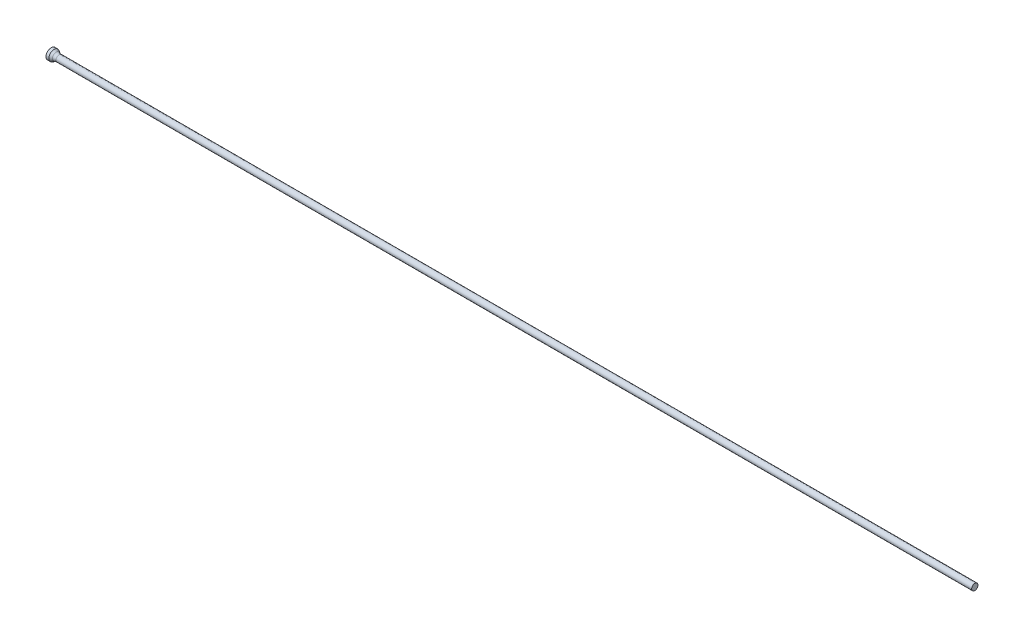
ISO-10303-21;
HEADER;
FILE_DESCRIPTION(('STEP AP214'),'2;1');
FILE_NAME('part.step','',(''),(''),'','','');
FILE_SCHEMA(('AUTOMOTIVE_DESIGN { 1 0 10303 214 1 1 1 1 }'));
ENDSEC;
DATA;
#1=APPLICATION_CONTEXT('core data for automotive mechanical design processes');
#2=APPLICATION_PROTOCOL_DEFINITION('international standard','automotive_design',2000,#1);
#3=PRODUCT_CONTEXT('',#1,'mechanical');
#4=PRODUCT('Part','Part','',(#3));
#5=PRODUCT_RELATED_PRODUCT_CATEGORY('part','',(#4));
#6=PRODUCT_DEFINITION_FORMATION('','',#4);
#7=PRODUCT_DEFINITION_CONTEXT('part definition',#1,'design');
#8=PRODUCT_DEFINITION('design','',#6,#7);
#9=PRODUCT_DEFINITION_SHAPE('','',#8);
#10=(LENGTH_UNIT() NAMED_UNIT(*) SI_UNIT(.MILLI.,.METRE.));
#11=(NAMED_UNIT(*) PLANE_ANGLE_UNIT() SI_UNIT($,.RADIAN.));
#12=(NAMED_UNIT(*) SI_UNIT($,.STERADIAN.) SOLID_ANGLE_UNIT());
#13=UNCERTAINTY_MEASURE_WITH_UNIT(LENGTH_MEASURE(1.E-05),#10,'distance_accuracy_value','');
#14=(GEOMETRIC_REPRESENTATION_CONTEXT(3) GLOBAL_UNCERTAINTY_ASSIGNED_CONTEXT((#13)) GLOBAL_UNIT_ASSIGNED_CONTEXT((#10,
#11,#12)) REPRESENTATION_CONTEXT('',''));
#15=CARTESIAN_POINT('',(0.,0.,0.));
#16=DIRECTION('',(0.,0.,1.));
#17=DIRECTION('',(1.,0.,0.));
#18=AXIS2_PLACEMENT_3D('',#15,#16,#17);
#19=CARTESIAN_POINT('',(0.,0.,0.));
#20=DIRECTION('',(1.,0.,0.));
#21=DIRECTION('',(0.,0.,-1.));
#22=AXIS2_PLACEMENT_3D('',#19,#20,#21);
#23=PLANE('',#22);
#24=CARTESIAN_POINT('',(0.,0.,0.));
#25=DIRECTION('',(-1.,0.,0.));
#26=DIRECTION('',(0.,0.,1.));
#27=AXIS2_PLACEMENT_3D('',#24,#25,#26);
#28=CIRCLE('',#27,0.9);
#29=CARTESIAN_POINT('',(0.,0.,0.9));
#30=VERTEX_POINT('',#29);
#31=EDGE_CURVE('E25',#30,#30,#28,.T.);
#32=ORIENTED_EDGE('',*,*,#31,.T.);
#33=EDGE_LOOP('',(#32));
#34=FACE_BOUND('',#33,.T.);
#35=ADVANCED_FACE('F14',(#34),#23,.F.);
#36=CARTESIAN_POINT('',(0.,0.,0.));
#37=DIRECTION('',(-1.,0.,0.));
#38=DIRECTION('',(0.,0.,1.));
#39=AXIS2_PLACEMENT_3D('',#36,#37,#38);
#40=CYLINDRICAL_SURFACE('',#39,0.9);
#41=ORIENTED_EDGE('',*,*,#31,.F.);
#42=EDGE_LOOP('',(#41));
#43=FACE_BOUND('',#42,.T.);
#44=CARTESIAN_POINT('',(0.503782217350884,0.,0.));
#45=DIRECTION('',(-1.,0.,0.));
#46=DIRECTION('',(0.,0.,1.));
#47=AXIS2_PLACEMENT_3D('',#44,#45,#46);
#48=CIRCLE('',#47,0.9);
#49=CARTESIAN_POINT('',(0.503782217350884,0.,0.9));
#50=VERTEX_POINT('',#49);
#51=EDGE_CURVE('E29',#50,#50,#48,.T.);
#52=ORIENTED_EDGE('',*,*,#51,.T.);
#53=EDGE_LOOP('',(#52));
#54=FACE_BOUND('',#53,.T.);
#55=ADVANCED_FACE('F53',(#43,#54),#40,.T.);
#56=CARTESIAN_POINT('',(1.11,0.,0.));
#57=DIRECTION('',(-1.,0.,0.));
#58=DIRECTION('',(0.,0.,1.));
#59=AXIS2_PLACEMENT_3D('',#56,#57,#58);
#60=CONICAL_SURFACE('',#59,0.55,0.523598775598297);
#61=CARTESIAN_POINT('',(0.877949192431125,0.,0.));
#62=DIRECTION('',(-1.,0.,0.));
#63=DIRECTION('',(0.,0.,1.));
#64=AXIS2_PLACEMENT_3D('',#61,#62,#63);
#65=CIRCLE('',#64,0.683974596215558);
#66=CARTESIAN_POINT('',(0.877949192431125,0.,0.683974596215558));
#67=VERTEX_POINT('',#66);
#68=EDGE_CURVE('E21',#67,#67,#65,.T.);
#69=ORIENTED_EDGE('',*,*,#68,.T.);
#70=EDGE_LOOP('',(#69));
#71=FACE_BOUND('',#70,.T.);
#72=ORIENTED_EDGE('',*,*,#51,.F.);
#73=EDGE_LOOP('',(#72));
#74=FACE_BOUND('',#73,.T.);
#75=ADVANCED_FACE('F50',(#71,#74),#60,.T.);
#76=CARTESIAN_POINT('',(0.,0.,0.));
#77=DIRECTION('',(-1.,0.,0.));
#78=DIRECTION('',(0.,0.,1.));
#79=AXIS2_PLACEMENT_3D('',#76,#77,#78);
#80=CYLINDRICAL_SURFACE('',#79,0.55);
#81=CARTESIAN_POINT('',(1.37794919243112,0.,0.));
#82=DIRECTION('',(-1.,0.,0.));
#83=DIRECTION('',(0.,0.,1.));
#84=AXIS2_PLACEMENT_3D('',#81,#82,#83);
#85=CIRCLE('',#84,0.55);
#86=CARTESIAN_POINT('',(1.37794919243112,0.,0.55));
#87=VERTEX_POINT('',#86);
#88=EDGE_CURVE('E9',#87,#87,#85,.F.);
#89=ORIENTED_EDGE('',*,*,#88,.T.);
#90=EDGE_LOOP('',(#89));
#91=FACE_BOUND('',#90,.T.);
#92=CARTESIAN_POINT('',(160.,0.,0.));
#93=DIRECTION('',(-1.,0.,0.));
#94=DIRECTION('',(0.,0.,1.));
#95=AXIS2_PLACEMENT_3D('',#92,#93,#94);
#96=CIRCLE('',#95,0.55);
#97=CARTESIAN_POINT('',(160.,0.,0.55));
#98=VERTEX_POINT('',#97);
#99=EDGE_CURVE('E34',#98,#98,#96,.T.);
#100=ORIENTED_EDGE('',*,*,#99,.T.);
#101=EDGE_LOOP('',(#100));
#102=FACE_BOUND('',#101,.T.);
#103=ADVANCED_FACE('F38',(#91,#102),#80,.T.);
#104=CARTESIAN_POINT('',(160.,0.55,0.));
#105=DIRECTION('',(-1.,0.,0.));
#106=DIRECTION('',(0.,0.,1.));
#107=AXIS2_PLACEMENT_3D('',#104,#105,#106);
#108=PLANE('',#107);
#109=ORIENTED_EDGE('',*,*,#99,.F.);
#110=EDGE_LOOP('',(#109));
#111=FACE_BOUND('',#110,.T.);
#112=ADVANCED_FACE('F40',(#111),#108,.F.);
#113=CARTESIAN_POINT('',(1.37794919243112,0.,0.));
#114=DIRECTION('',(-1.,0.,0.));
#115=DIRECTION('',(0.,0.,1.));
#116=AXIS2_PLACEMENT_3D('',#113,#114,#115);
#117=TOROIDAL_SURFACE('',#116,1.55,1.);
#118=ORIENTED_EDGE('',*,*,#88,.F.);
#119=EDGE_LOOP('',(#118));
#120=FACE_BOUND('',#119,.T.);
#121=ORIENTED_EDGE('',*,*,#68,.F.);
#122=EDGE_LOOP('',(#121));
#123=FACE_BOUND('',#122,.T.);
#124=ADVANCED_FACE('F16',(#120,#123),#117,.F.);
#125=CLOSED_SHELL('',(#35,#55,#75,#103,#112,#124));
#126=MANIFOLD_SOLID_BREP('B1',#125);
#127=ADVANCED_BREP_SHAPE_REPRESENTATION('',(#18,#126),#14);
#128=SHAPE_DEFINITION_REPRESENTATION(#9,#127);
ENDSEC;
END-ISO-10303-21;
